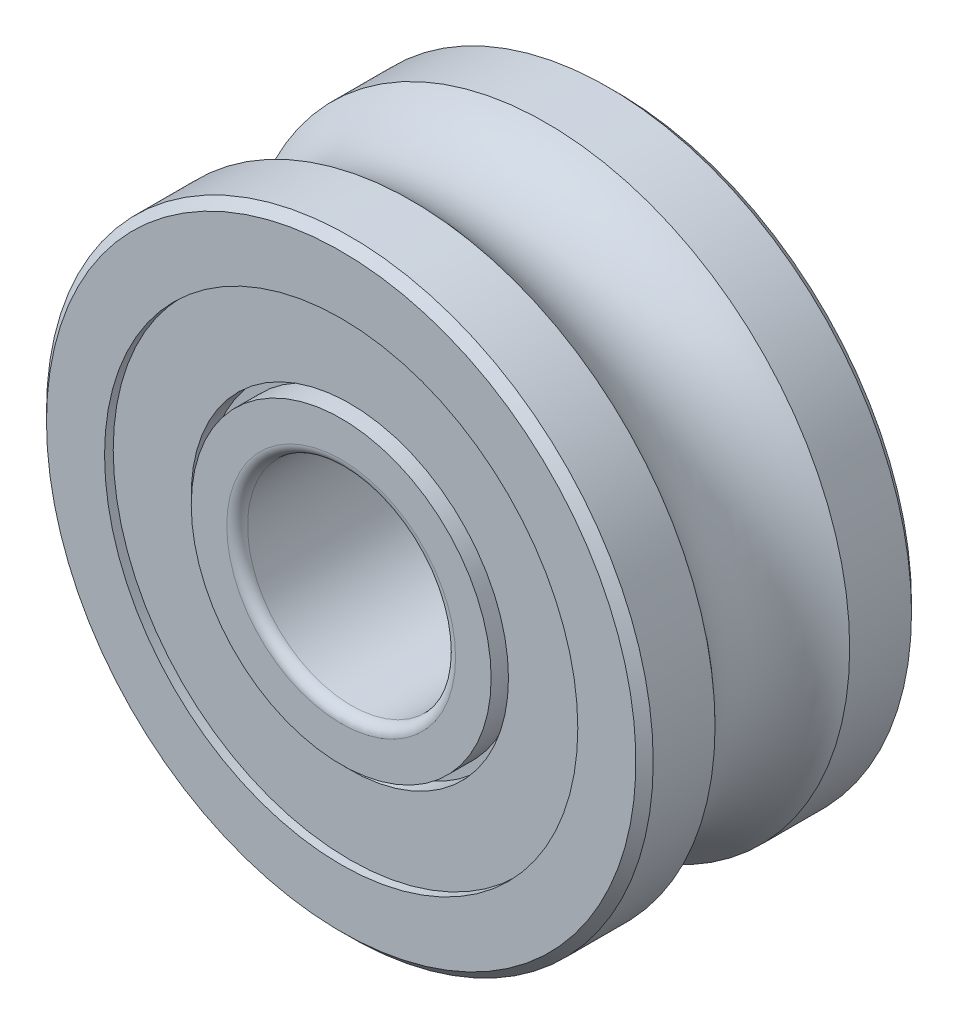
ISO-10303-21;
HEADER;
FILE_DESCRIPTION(('STEP AP214'),'2;1');
FILE_NAME('part.step','',(''),(''),'','','');
FILE_SCHEMA(('AUTOMOTIVE_DESIGN { 1 0 10303 214 1 1 1 1 }'));
ENDSEC;
DATA;
#1=APPLICATION_CONTEXT('core data for automotive mechanical design processes');
#2=APPLICATION_PROTOCOL_DEFINITION('international standard','automotive_design',2000,#1);
#3=PRODUCT_CONTEXT('',#1,'mechanical');
#4=PRODUCT('Part','Part','',(#3));
#5=PRODUCT_RELATED_PRODUCT_CATEGORY('part','',(#4));
#6=PRODUCT_DEFINITION_FORMATION('','',#4);
#7=PRODUCT_DEFINITION_CONTEXT('part definition',#1,'design');
#8=PRODUCT_DEFINITION('design','',#6,#7);
#9=PRODUCT_DEFINITION_SHAPE('','',#8);
#10=(LENGTH_UNIT() NAMED_UNIT(*) SI_UNIT(.MILLI.,.METRE.));
#11=(NAMED_UNIT(*) PLANE_ANGLE_UNIT() SI_UNIT($,.RADIAN.));
#12=(NAMED_UNIT(*) SI_UNIT($,.STERADIAN.) SOLID_ANGLE_UNIT());
#13=UNCERTAINTY_MEASURE_WITH_UNIT(LENGTH_MEASURE(1.E-05),#10,'distance_accuracy_value','');
#14=(GEOMETRIC_REPRESENTATION_CONTEXT(3) GLOBAL_UNCERTAINTY_ASSIGNED_CONTEXT((#13)) GLOBAL_UNIT_ASSIGNED_CONTEXT((#10,
#11,#12)) REPRESENTATION_CONTEXT('',''));
#15=CARTESIAN_POINT('',(0.,0.,0.));
#16=DIRECTION('',(0.,0.,1.));
#17=DIRECTION('',(1.,0.,0.));
#18=AXIS2_PLACEMENT_3D('',#15,#16,#17);
#19=CARTESIAN_POINT('',(0.,8.65,6.45));
#20=DIRECTION('',(0.,0.,-1.));
#21=DIRECTION('',(-1.,0.,0.));
#22=AXIS2_PLACEMENT_3D('',#19,#20,#21);
#23=PLANE('',#22);
#24=CARTESIAN_POINT('',(0.,0.,6.45));
#25=DIRECTION('',(0.,0.,1.));
#26=DIRECTION('',(1.,0.,0.));
#27=AXIS2_PLACEMENT_3D('',#24,#25,#26);
#28=CIRCLE('',#27,9.15);
#29=CARTESIAN_POINT('',(9.15,0.,6.45));
#30=VERTEX_POINT('',#29);
#31=EDGE_CURVE('E200',#30,#30,#28,.T.);
#32=ORIENTED_EDGE('',*,*,#31,.T.);
#33=EDGE_LOOP('',(#32));
#34=FACE_BOUND('',#33,.T.);
#35=CARTESIAN_POINT('',(0.,0.,6.45));
#36=DIRECTION('',(0.,0.,1.));
#37=DIRECTION('',(1.,0.,0.));
#38=AXIS2_PLACEMENT_3D('',#35,#36,#37);
#39=CIRCLE('',#38,8.65);
#40=CARTESIAN_POINT('',(8.65,0.,6.45));
#41=VERTEX_POINT('',#40);
#42=EDGE_CURVE('E197',#41,#41,#39,.T.);
#43=ORIENTED_EDGE('',*,*,#42,.F.);
#44=EDGE_LOOP('',(#43));
#45=FACE_BOUND('',#44,.T.);
#46=ADVANCED_FACE('F14',(#34,#45),#23,.F.);
#47=CARTESIAN_POINT('',(0.,0.,38.6779652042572));
#48=DIRECTION('',(0.,0.,1.));
#49=DIRECTION('',(1.,0.,0.));
#50=AXIS2_PLACEMENT_3D('',#47,#48,#49);
#51=CYLINDRICAL_SURFACE('',#50,8.65);
#52=CARTESIAN_POINT('',(0.,0.,7.95));
#53=DIRECTION('',(0.,0.,1.));
#54=DIRECTION('',(1.,0.,0.));
#55=AXIS2_PLACEMENT_3D('',#52,#53,#54);
#56=CIRCLE('',#55,8.65);
#57=CARTESIAN_POINT('',(8.65,0.,7.95));
#58=VERTEX_POINT('',#57);
#59=EDGE_CURVE('E203',#58,#58,#56,.F.);
#60=ORIENTED_EDGE('',*,*,#59,.T.);
#61=EDGE_LOOP('',(#60));
#62=FACE_BOUND('',#61,.T.);
#63=ORIENTED_EDGE('',*,*,#42,.T.);
#64=EDGE_LOOP('',(#63));
#65=FACE_BOUND('',#64,.T.);
#66=ADVANCED_FACE('F83',(#62,#65),#51,.T.);
#67=CARTESIAN_POINT('',(0.,0.,38.6779652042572));
#68=DIRECTION('',(0.,0.,1.));
#69=DIRECTION('',(1.,0.,0.));
#70=AXIS2_PLACEMENT_3D('',#67,#68,#69);
#71=CYLINDRICAL_SURFACE('',#70,9.15);
#72=ORIENTED_EDGE('',*,*,#31,.F.);
#73=EDGE_LOOP('',(#72));
#74=FACE_BOUND('',#73,.T.);
#75=CARTESIAN_POINT('',(0.,0.,7.45));
#76=DIRECTION('',(0.,0.,1.));
#77=DIRECTION('',(1.,0.,0.));
#78=AXIS2_PLACEMENT_3D('',#75,#76,#77);
#79=CIRCLE('',#78,9.15);
#80=CARTESIAN_POINT('',(9.15,0.,7.45));
#81=VERTEX_POINT('',#80);
#82=EDGE_CURVE('E54',#81,#81,#79,.T.);
#83=ORIENTED_EDGE('',*,*,#82,.T.);
#84=EDGE_LOOP('',(#83));
#85=FACE_BOUND('',#84,.T.);
#86=ADVANCED_FACE('F72',(#74,#85),#71,.F.);
#87=CARTESIAN_POINT('',(0.,8.65,7.95));
#88=DIRECTION('',(0.,0.,-1.));
#89=DIRECTION('',(-1.,0.,0.));
#90=AXIS2_PLACEMENT_3D('',#87,#88,#89);
#91=PLANE('',#90);
#92=ORIENTED_EDGE('',*,*,#59,.F.);
#93=EDGE_LOOP('',(#92));
#94=FACE_BOUND('',#93,.T.);
#95=CARTESIAN_POINT('',(0.,0.,7.95));
#96=DIRECTION('',(0.,0.,1.));
#97=DIRECTION('',(-1.,0.,0.));
#98=AXIS2_PLACEMENT_3D('',#95,#96,#97);
#99=CIRCLE('',#98,6.6);
#100=CARTESIAN_POINT('',(-6.6,0.,7.95));
#101=VERTEX_POINT('',#100);
#102=CARTESIAN_POINT('',(6.6,0.,7.95));
#103=VERTEX_POINT('',#102);
#104=EDGE_CURVE('E42',#101,#103,#99,.T.);
#105=ORIENTED_EDGE('',*,*,#104,.F.);
#106=CARTESIAN_POINT('',(0.,0.,7.95));
#107=DIRECTION('',(0.,0.,1.));
#108=DIRECTION('',(1.,0.,0.));
#109=AXIS2_PLACEMENT_3D('',#106,#107,#108);
#110=CIRCLE('',#109,6.6);
#111=EDGE_CURVE('E44',#103,#101,#110,.T.);
#112=ORIENTED_EDGE('',*,*,#111,.F.);
#113=EDGE_LOOP('',(#105,#112));
#114=FACE_BOUND('',#113,.T.);
#115=ADVANCED_FACE('F53',(#94,#114),#91,.F.);
#116=CARTESIAN_POINT('',(0.,13.65,7.45));
#117=DIRECTION('',(0.,0.,-1.));
#118=DIRECTION('',(-1.,0.,0.));
#119=AXIS2_PLACEMENT_3D('',#116,#117,#118);
#120=PLANE('',#119);
#121=CARTESIAN_POINT('',(0.,0.,7.45));
#122=DIRECTION('',(0.,0.,1.));
#123=DIRECTION('',(1.,0.,0.));
#124=AXIS2_PLACEMENT_3D('',#121,#122,#123);
#125=CIRCLE('',#124,13.65);
#126=CARTESIAN_POINT('',(13.65,0.,7.45));
#127=VERTEX_POINT('',#126);
#128=EDGE_CURVE('E49',#127,#127,#125,.T.);
#129=ORIENTED_EDGE('',*,*,#128,.T.);
#130=EDGE_LOOP('',(#129));
#131=FACE_BOUND('',#130,.T.);
#132=ORIENTED_EDGE('',*,*,#82,.F.);
#133=EDGE_LOOP('',(#132));
#134=FACE_BOUND('',#133,.T.);
#135=ADVANCED_FACE('F71',(#131,#134),#120,.F.);
#136=CARTESIAN_POINT('',(0.,0.,7.35));
#137=DIRECTION('',(0.,0.,1.));
#138=DIRECTION('',(1.,0.,0.));
#139=AXIS2_PLACEMENT_3D('',#136,#137,#138);
#140=TOROIDAL_SURFACE('',#139,6.6,0.6);
#141=CARTESIAN_POINT('',(0.,0.,7.35));
#142=DIRECTION('',(0.,0.,1.));
#143=DIRECTION('',(1.,0.,0.));
#144=AXIS2_PLACEMENT_3D('',#141,#142,#143);
#145=CIRCLE('',#144,6.);
#146=CARTESIAN_POINT('',(6.,0.,7.35));
#147=VERTEX_POINT('',#146);
#148=EDGE_CURVE('E209',#147,#147,#145,.F.);
#149=ORIENTED_EDGE('',*,*,#148,.T.);
#150=EDGE_LOOP('',(#149));
#151=FACE_BOUND('',#150,.T.);
#152=ORIENTED_EDGE('',*,*,#111,.T.);
#153=ORIENTED_EDGE('',*,*,#104,.T.);
#154=EDGE_LOOP('',(#152,#153));
#155=FACE_BOUND('',#154,.T.);
#156=ADVANCED_FACE('F46',(#151,#155),#140,.T.);
#157=CARTESIAN_POINT('',(0.,0.,38.6779652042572));
#158=DIRECTION('',(0.,0.,1.));
#159=DIRECTION('',(1.,0.,0.));
#160=AXIS2_PLACEMENT_3D('',#157,#158,#159);
#161=CYLINDRICAL_SURFACE('',#160,13.65);
#162=ORIENTED_EDGE('',*,*,#128,.F.);
#163=EDGE_LOOP('',(#162));
#164=FACE_BOUND('',#163,.T.);
#165=CARTESIAN_POINT('',(0.,0.,7.95));
#166=DIRECTION('',(0.,0.,1.));
#167=DIRECTION('',(1.,0.,0.));
#168=AXIS2_PLACEMENT_3D('',#165,#166,#167);
#169=CIRCLE('',#168,13.65);
#170=CARTESIAN_POINT('',(13.65,0.,7.95));
#171=VERTEX_POINT('',#170);
#172=EDGE_CURVE('E210',#171,#171,#169,.T.);
#173=ORIENTED_EDGE('',*,*,#172,.T.);
#174=EDGE_LOOP('',(#173));
#175=FACE_BOUND('',#174,.T.);
#176=ADVANCED_FACE('F242',(#164,#175),#161,.F.);
#177=CARTESIAN_POINT('',(0.,0.,38.6779652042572));
#178=DIRECTION('',(0.,0.,1.));
#179=DIRECTION('',(1.,0.,0.));
#180=AXIS2_PLACEMENT_3D('',#177,#178,#179);
#181=CYLINDRICAL_SURFACE('',#180,6.);
#182=CARTESIAN_POINT('',(0.,0.,-7.35));
#183=DIRECTION('',(0.,0.,1.));
#184=DIRECTION('',(1.,0.,0.));
#185=AXIS2_PLACEMENT_3D('',#182,#183,#184);
#186=CIRCLE('',#185,6.);
#187=CARTESIAN_POINT('',(6.,0.,-7.35));
#188=VERTEX_POINT('',#187);
#189=EDGE_CURVE('E213',#188,#188,#186,.T.);
#190=ORIENTED_EDGE('',*,*,#189,.F.);
#191=EDGE_LOOP('',(#190));
#192=FACE_BOUND('',#191,.T.);
#193=ORIENTED_EDGE('',*,*,#148,.F.);
#194=EDGE_LOOP('',(#193));
#195=FACE_BOUND('',#194,.T.);
#196=ADVANCED_FACE('F246',(#192,#195),#181,.F.);
#197=CARTESIAN_POINT('',(0.,17.,7.95));
#198=DIRECTION('',(0.,0.,-1.));
#199=DIRECTION('',(-1.,0.,0.));
#200=AXIS2_PLACEMENT_3D('',#197,#198,#199);
#201=PLANE('',#200);
#202=CARTESIAN_POINT('',(0.,0.,7.95));
#203=DIRECTION('',(0.,0.,-1.));
#204=DIRECTION('',(-1.,0.,0.));
#205=AXIS2_PLACEMENT_3D('',#202,#203,#204);
#206=CIRCLE('',#205,17.);
#207=CARTESIAN_POINT('',(-17.,0.,7.95));
#208=VERTEX_POINT('',#207);
#209=EDGE_CURVE('E214',#208,#208,#206,.T.);
#210=ORIENTED_EDGE('',*,*,#209,.F.);
#211=EDGE_LOOP('',(#210));
#212=FACE_BOUND('',#211,.T.);
#213=ORIENTED_EDGE('',*,*,#172,.F.);
#214=EDGE_LOOP('',(#213));
#215=FACE_BOUND('',#214,.T.);
#216=ADVANCED_FACE('F180',(#212,#215),#201,.F.);
#217=CARTESIAN_POINT('',(0.,0.,-7.35));
#218=DIRECTION('',(0.,0.,1.));
#219=DIRECTION('',(1.,0.,0.));
#220=AXIS2_PLACEMENT_3D('',#217,#218,#219);
#221=TOROIDAL_SURFACE('',#220,6.6,0.6);
#222=CARTESIAN_POINT('',(0.,0.,-7.95));
#223=DIRECTION('',(0.,0.,-1.));
#224=DIRECTION('',(1.,0.,0.));
#225=AXIS2_PLACEMENT_3D('',#222,#223,#224);
#226=CIRCLE('',#225,6.6);
#227=CARTESIAN_POINT('',(6.6,0.,-7.95));
#228=VERTEX_POINT('',#227);
#229=CARTESIAN_POINT('',(-6.6,0.,-7.95));
#230=VERTEX_POINT('',#229);
#231=EDGE_CURVE('E143',#228,#230,#226,.T.);
#232=ORIENTED_EDGE('',*,*,#231,.T.);
#233=CARTESIAN_POINT('',(0.,0.,-7.95));
#234=DIRECTION('',(0.,0.,-1.));
#235=DIRECTION('',(-1.,0.,0.));
#236=AXIS2_PLACEMENT_3D('',#233,#234,#235);
#237=CIRCLE('',#236,6.6);
#238=EDGE_CURVE('E33',#230,#228,#237,.T.);
#239=ORIENTED_EDGE('',*,*,#238,.T.);
#240=EDGE_LOOP('',(#232,#239));
#241=FACE_BOUND('',#240,.T.);
#242=ORIENTED_EDGE('',*,*,#189,.T.);
#243=EDGE_LOOP('',(#242));
#244=FACE_BOUND('',#243,.T.);
#245=ADVANCED_FACE('F176',(#241,#244),#221,.T.);
#246=CARTESIAN_POINT('',(0.,0.,7.45));
#247=DIRECTION('',(0.,0.,-1.));
#248=DIRECTION('',(-1.,0.,0.));
#249=AXIS2_PLACEMENT_3D('',#246,#247,#248);
#250=CONICAL_SURFACE('',#249,17.5,0.785398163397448);
#251=CARTESIAN_POINT('',(0.,0.,7.45));
#252=DIRECTION('',(0.,0.,1.));
#253=DIRECTION('',(1.,0.,0.));
#254=AXIS2_PLACEMENT_3D('',#251,#252,#253);
#255=CIRCLE('',#254,17.5);
#256=CARTESIAN_POINT('',(17.5,0.,7.45));
#257=VERTEX_POINT('',#256);
#258=EDGE_CURVE('E165',#257,#257,#255,.F.);
#259=ORIENTED_EDGE('',*,*,#258,.F.);
#260=EDGE_LOOP('',(#259));
#261=FACE_BOUND('',#260,.T.);
#262=ORIENTED_EDGE('',*,*,#209,.T.);
#263=EDGE_LOOP('',(#262));
#264=FACE_BOUND('',#263,.T.);
#265=ADVANCED_FACE('F159',(#261,#264),#250,.T.);
#266=CARTESIAN_POINT('',(0.,8.65,-7.95));
#267=DIRECTION('',(0.,0.,1.));
#268=DIRECTION('',(1.,0.,0.));
#269=AXIS2_PLACEMENT_3D('',#266,#267,#268);
#270=PLANE('',#269);
#271=ORIENTED_EDGE('',*,*,#231,.F.);
#272=ORIENTED_EDGE('',*,*,#238,.F.);
#273=EDGE_LOOP('',(#271,#272));
#274=FACE_BOUND('',#273,.T.);
#275=CARTESIAN_POINT('',(0.,0.,-7.95));
#276=DIRECTION('',(0.,0.,1.));
#277=DIRECTION('',(1.,0.,0.));
#278=AXIS2_PLACEMENT_3D('',#275,#276,#277);
#279=CIRCLE('',#278,8.65);
#280=CARTESIAN_POINT('',(8.65,0.,-7.95));
#281=VERTEX_POINT('',#280);
#282=EDGE_CURVE('E141',#281,#281,#279,.T.);
#283=ORIENTED_EDGE('',*,*,#282,.F.);
#284=EDGE_LOOP('',(#283));
#285=FACE_BOUND('',#284,.T.);
#286=ADVANCED_FACE('F148',(#274,#285),#270,.F.);
#287=CARTESIAN_POINT('',(0.,0.,38.6779652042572));
#288=DIRECTION('',(0.,0.,1.));
#289=DIRECTION('',(1.,0.,0.));
#290=AXIS2_PLACEMENT_3D('',#287,#288,#289);
#291=CYLINDRICAL_SURFACE('',#290,17.5);
#292=ORIENTED_EDGE('',*,*,#258,.T.);
#293=EDGE_LOOP('',(#292));
#294=FACE_BOUND('',#293,.T.);
#295=CARTESIAN_POINT('',(0.,0.,3.88297566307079));
#296=DIRECTION('',(0.,0.,1.));
#297=DIRECTION('',(1.,0.,0.));
#298=AXIS2_PLACEMENT_3D('',#295,#296,#297);
#299=CIRCLE('',#298,17.5);
#300=CARTESIAN_POINT('',(17.5,0.,3.88297566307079));
#301=VERTEX_POINT('',#300);
#302=EDGE_CURVE('E137',#301,#301,#299,.T.);
#303=ORIENTED_EDGE('',*,*,#302,.T.);
#304=EDGE_LOOP('',(#303));
#305=FACE_BOUND('',#304,.T.);
#306=ADVANCED_FACE('F158',(#294,#305),#291,.T.);
#307=CARTESIAN_POINT('',(0.,0.,38.6779652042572));
#308=DIRECTION('',(0.,0.,1.));
#309=DIRECTION('',(1.,0.,0.));
#310=AXIS2_PLACEMENT_3D('',#307,#308,#309);
#311=CYLINDRICAL_SURFACE('',#310,8.65);
#312=CARTESIAN_POINT('',(0.,0.,-6.45));
#313=DIRECTION('',(0.,0.,1.));
#314=DIRECTION('',(1.,0.,0.));
#315=AXIS2_PLACEMENT_3D('',#312,#313,#314);
#316=CIRCLE('',#315,8.65);
#317=CARTESIAN_POINT('',(8.65,0.,-6.45));
#318=VERTEX_POINT('',#317);
#319=EDGE_CURVE('E140',#318,#318,#316,.F.);
#320=ORIENTED_EDGE('',*,*,#319,.T.);
#321=EDGE_LOOP('',(#320));
#322=FACE_BOUND('',#321,.T.);
#323=ORIENTED_EDGE('',*,*,#282,.T.);
#324=EDGE_LOOP('',(#323));
#325=FACE_BOUND('',#324,.T.);
#326=ADVANCED_FACE('F278',(#322,#325),#311,.T.);
#327=CARTESIAN_POINT('',(0.,8.65,-6.45));
#328=DIRECTION('',(0.,0.,1.));
#329=DIRECTION('',(1.,0.,0.));
#330=AXIS2_PLACEMENT_3D('',#327,#328,#329);
#331=PLANE('',#330);
#332=ORIENTED_EDGE('',*,*,#319,.F.);
#333=EDGE_LOOP('',(#332));
#334=FACE_BOUND('',#333,.T.);
#335=CARTESIAN_POINT('',(0.,0.,-6.45));
#336=DIRECTION('',(0.,0.,1.));
#337=DIRECTION('',(1.,0.,0.));
#338=AXIS2_PLACEMENT_3D('',#335,#336,#337);
#339=CIRCLE('',#338,9.15);
#340=CARTESIAN_POINT('',(9.15,0.,-6.45));
#341=VERTEX_POINT('',#340);
#342=EDGE_CURVE('E221',#341,#341,#339,.F.);
#343=ORIENTED_EDGE('',*,*,#342,.T.);
#344=EDGE_LOOP('',(#343));
#345=FACE_BOUND('',#344,.T.);
#346=ADVANCED_FACE('F129',(#334,#345),#331,.F.);
#347=CARTESIAN_POINT('',(0.,0.,0.));
#348=DIRECTION('',(0.,0.,1.));
#349=DIRECTION('',(1.,0.,0.));
#350=AXIS2_PLACEMENT_3D('',#347,#348,#349);
#351=TOROIDAL_SURFACE('',#350,20.65,5.);
#352=ORIENTED_EDGE('',*,*,#302,.F.);
#353=EDGE_LOOP('',(#352));
#354=FACE_BOUND('',#353,.T.);
#355=CARTESIAN_POINT('',(0.,0.,-3.88297566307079));
#356=DIRECTION('',(0.,0.,1.));
#357=DIRECTION('',(1.,0.,0.));
#358=AXIS2_PLACEMENT_3D('',#355,#356,#357);
#359=CIRCLE('',#358,17.5);
#360=CARTESIAN_POINT('',(17.5,0.,-3.88297566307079));
#361=VERTEX_POINT('',#360);
#362=EDGE_CURVE('E135',#361,#361,#359,.F.);
#363=ORIENTED_EDGE('',*,*,#362,.F.);
#364=EDGE_LOOP('',(#363));
#365=FACE_BOUND('',#364,.T.);
#366=ADVANCED_FACE('F124',(#354,#365),#351,.F.);
#367=CARTESIAN_POINT('',(0.,0.,38.6779652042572));
#368=DIRECTION('',(0.,0.,1.));
#369=DIRECTION('',(1.,0.,0.));
#370=AXIS2_PLACEMENT_3D('',#367,#368,#369);
#371=CYLINDRICAL_SURFACE('',#370,9.15);
#372=CARTESIAN_POINT('',(0.,0.,-7.45));
#373=DIRECTION('',(0.,0.,1.));
#374=DIRECTION('',(1.,0.,0.));
#375=AXIS2_PLACEMENT_3D('',#372,#373,#374);
#376=CIRCLE('',#375,9.15);
#377=CARTESIAN_POINT('',(9.15,0.,-7.45));
#378=VERTEX_POINT('',#377);
#379=EDGE_CURVE('E224',#378,#378,#376,.F.);
#380=ORIENTED_EDGE('',*,*,#379,.T.);
#381=EDGE_LOOP('',(#380));
#382=FACE_BOUND('',#381,.T.);
#383=ORIENTED_EDGE('',*,*,#342,.F.);
#384=EDGE_LOOP('',(#383));
#385=FACE_BOUND('',#384,.T.);
#386=ADVANCED_FACE('F120',(#382,#385),#371,.F.);
#387=CARTESIAN_POINT('',(0.,0.,38.6779652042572));
#388=DIRECTION('',(0.,0.,1.));
#389=DIRECTION('',(1.,0.,0.));
#390=AXIS2_PLACEMENT_3D('',#387,#388,#389);
#391=CYLINDRICAL_SURFACE('',#390,17.5);
#392=ORIENTED_EDGE('',*,*,#362,.T.);
#393=EDGE_LOOP('',(#392));
#394=FACE_BOUND('',#393,.T.);
#395=CARTESIAN_POINT('',(0.,0.,-7.45));
#396=DIRECTION('',(0.,0.,1.));
#397=DIRECTION('',(1.,0.,0.));
#398=AXIS2_PLACEMENT_3D('',#395,#396,#397);
#399=CIRCLE('',#398,17.5);
#400=CARTESIAN_POINT('',(17.5,0.,-7.45));
#401=VERTEX_POINT('',#400);
#402=EDGE_CURVE('E227',#401,#401,#399,.F.);
#403=ORIENTED_EDGE('',*,*,#402,.F.);
#404=EDGE_LOOP('',(#403));
#405=FACE_BOUND('',#404,.T.);
#406=ADVANCED_FACE('F116',(#394,#405),#391,.T.);
#407=CARTESIAN_POINT('',(0.,13.65,-7.45));
#408=DIRECTION('',(0.,0.,1.));
#409=DIRECTION('',(1.,0.,0.));
#410=AXIS2_PLACEMENT_3D('',#407,#408,#409);
#411=PLANE('',#410);
#412=ORIENTED_EDGE('',*,*,#379,.F.);
#413=EDGE_LOOP('',(#412));
#414=FACE_BOUND('',#413,.T.);
#415=CARTESIAN_POINT('',(0.,0.,-7.45));
#416=DIRECTION('',(0.,0.,1.));
#417=DIRECTION('',(1.,0.,0.));
#418=AXIS2_PLACEMENT_3D('',#415,#416,#417);
#419=CIRCLE('',#418,13.65);
#420=CARTESIAN_POINT('',(13.65,0.,-7.45));
#421=VERTEX_POINT('',#420);
#422=EDGE_CURVE('E228',#421,#421,#419,.F.);
#423=ORIENTED_EDGE('',*,*,#422,.T.);
#424=EDGE_LOOP('',(#423));
#425=FACE_BOUND('',#424,.T.);
#426=ADVANCED_FACE('F112',(#414,#425),#411,.F.);
#427=CARTESIAN_POINT('',(0.,0.,-7.45));
#428=DIRECTION('',(0.,0.,1.));
#429=DIRECTION('',(1.,0.,0.));
#430=AXIS2_PLACEMENT_3D('',#427,#428,#429);
#431=CONICAL_SURFACE('',#430,17.5,0.785398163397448);
#432=ORIENTED_EDGE('',*,*,#402,.T.);
#433=EDGE_LOOP('',(#432));
#434=FACE_BOUND('',#433,.T.);
#435=CARTESIAN_POINT('',(0.,0.,-7.95));
#436=DIRECTION('',(0.,0.,1.));
#437=DIRECTION('',(1.,0.,0.));
#438=AXIS2_PLACEMENT_3D('',#435,#436,#437);
#439=CIRCLE('',#438,17.);
#440=CARTESIAN_POINT('',(17.,0.,-7.95));
#441=VERTEX_POINT('',#440);
#442=EDGE_CURVE('E25',#441,#441,#439,.T.);
#443=ORIENTED_EDGE('',*,*,#442,.T.);
#444=EDGE_LOOP('',(#443));
#445=FACE_BOUND('',#444,.T.);
#446=ADVANCED_FACE('F104',(#434,#445),#431,.T.);
#447=CARTESIAN_POINT('',(0.,0.,38.6779652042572));
#448=DIRECTION('',(0.,0.,1.));
#449=DIRECTION('',(1.,0.,0.));
#450=AXIS2_PLACEMENT_3D('',#447,#448,#449);
#451=CYLINDRICAL_SURFACE('',#450,13.65);
#452=CARTESIAN_POINT('',(0.,0.,-7.95));
#453=DIRECTION('',(0.,0.,1.));
#454=DIRECTION('',(1.,0.,0.));
#455=AXIS2_PLACEMENT_3D('',#452,#453,#454);
#456=CIRCLE('',#455,13.65);
#457=CARTESIAN_POINT('',(13.65,0.,-7.95));
#458=VERTEX_POINT('',#457);
#459=EDGE_CURVE('E9',#458,#458,#456,.F.);
#460=ORIENTED_EDGE('',*,*,#459,.T.);
#461=EDGE_LOOP('',(#460));
#462=FACE_BOUND('',#461,.T.);
#463=ORIENTED_EDGE('',*,*,#422,.F.);
#464=EDGE_LOOP('',(#463));
#465=FACE_BOUND('',#464,.T.);
#466=ADVANCED_FACE('F97',(#462,#465),#451,.F.);
#467=CARTESIAN_POINT('',(0.,17.,-7.95));
#468=DIRECTION('',(0.,0.,1.));
#469=DIRECTION('',(1.,0.,0.));
#470=AXIS2_PLACEMENT_3D('',#467,#468,#469);
#471=PLANE('',#470);
#472=ORIENTED_EDGE('',*,*,#459,.F.);
#473=EDGE_LOOP('',(#472));
#474=FACE_BOUND('',#473,.T.);
#475=ORIENTED_EDGE('',*,*,#442,.F.);
#476=EDGE_LOOP('',(#475));
#477=FACE_BOUND('',#476,.T.);
#478=ADVANCED_FACE('F95',(#474,#477),#471,.F.);
#479=CLOSED_SHELL('',(#46,#66,#86,#115,#135,#156,#176,#196,#216,#245,#265,#286,#306,#326,#346,
#366,#386,#406,#426,#446,#466,#478));
#480=MANIFOLD_SOLID_BREP('B1',#479);
#481=ADVANCED_BREP_SHAPE_REPRESENTATION('',(#18,#480),#14);
#482=SHAPE_DEFINITION_REPRESENTATION(#9,#481);
ENDSEC;
END-ISO-10303-21;
